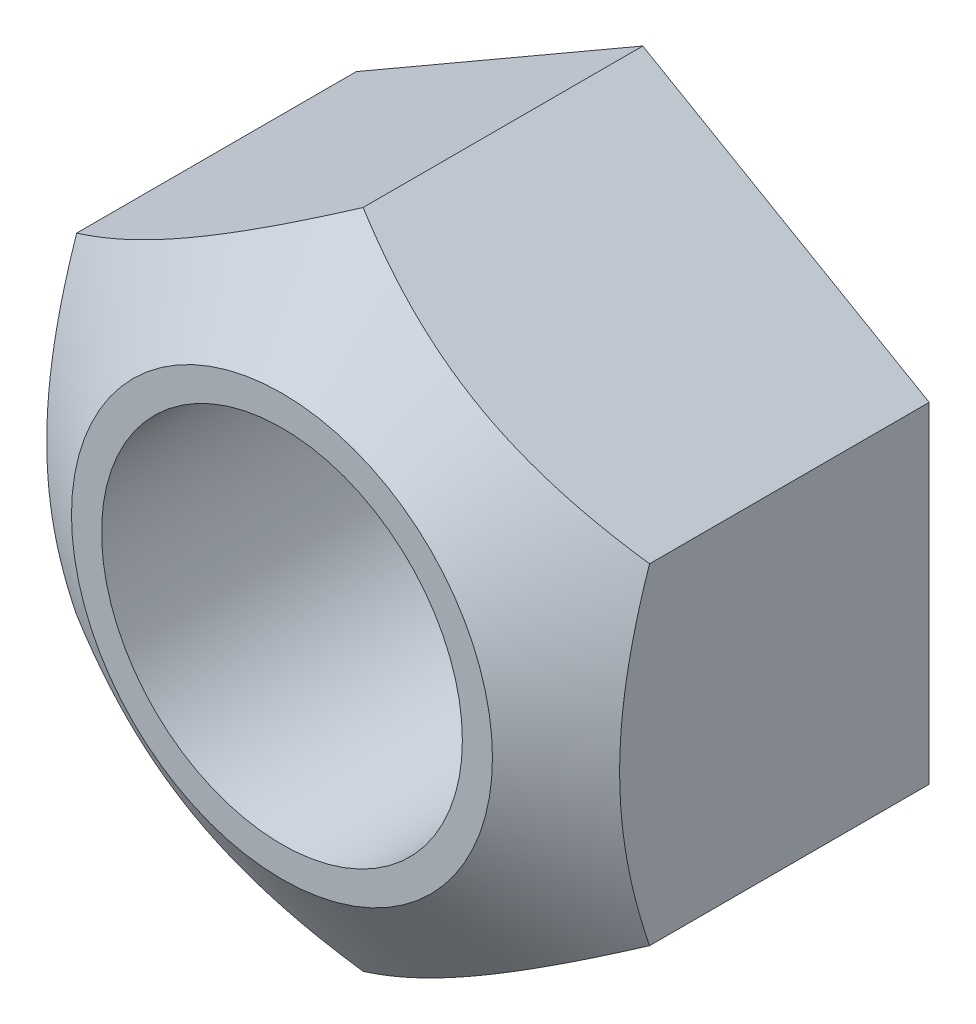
from build123d import *

# Parameters (mm, degrees)
EXTRUSION1_DEPTH        = 6
ESQUISSE2_R             = 3
ENL_V_MAT_EXTRU_1_DEPTH = 6
ESQUISSE3_R             = 10.240110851
ESQUISSE3_R_2           = 3.5
ENL_V_MAT_EXTRU_4_DEPTH = 6
ENL_V_MAT_EXTRU_4_TAPER = 56


with BuildPart() as part:
    # Esquisse1 → Extrusion1 (new body)
    with BuildSketch(Plane.XY):
        Polygon((-4.763139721, -2.75), (0, -5.5), (4.763139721, -2.75), (4.763139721, 2.75), (0, 5.5), (-4.763139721, 2.75), align=None)
    extrude(amount=EXTRUSION1_DEPTH)

    # Esquisse2 → Enl_v. mat.-Extru.1 (cut)
    with BuildSketch(Plane.XY.offset(6)):
        Circle(ESQUISSE2_R)
    extrude(amount=-ENL_V_MAT_EXTRU_1_DEPTH, mode=Mode.SUBTRACT)

    # Esquisse3 → Enl_v. mat.-Extru.4 (cut)
    with BuildSketch(Plane.XY.offset(6)):
        Circle(ESQUISSE3_R)
        Circle(ESQUISSE3_R_2, mode=Mode.SUBTRACT)
    extrude(amount=-ENL_V_MAT_EXTRU_4_DEPTH, taper=ENL_V_MAT_EXTRU_4_TAPER, mode=Mode.SUBTRACT)


solid = part.part
